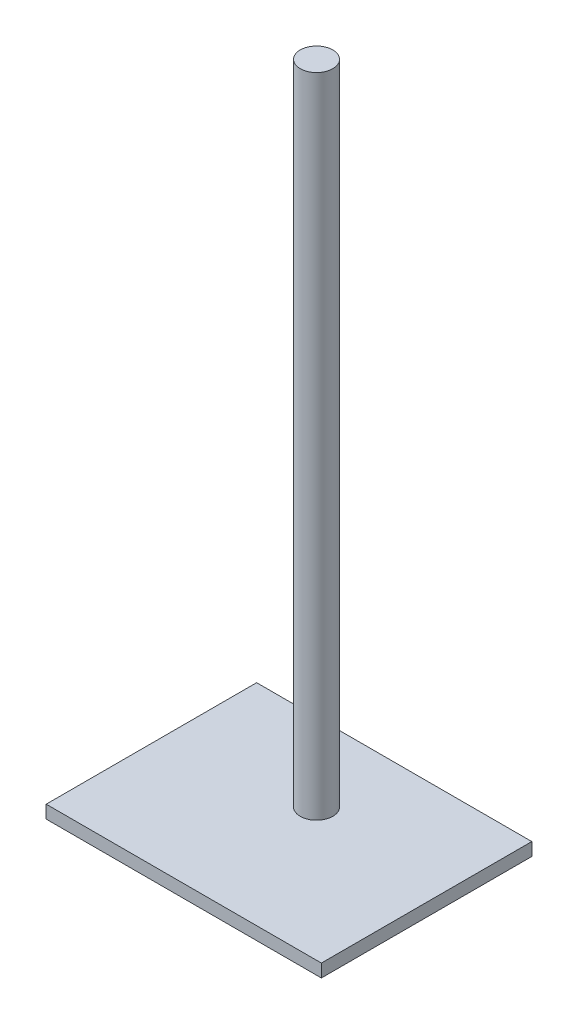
ISO-10303-21;
HEADER;
FILE_DESCRIPTION(('STEP AP214'),'2;1');
FILE_NAME('part.step','',(''),(''),'','','');
FILE_SCHEMA(('AUTOMOTIVE_DESIGN { 1 0 10303 214 1 1 1 1 }'));
ENDSEC;
DATA;
#1=APPLICATION_CONTEXT('core data for automotive mechanical design processes');
#2=APPLICATION_PROTOCOL_DEFINITION('international standard','automotive_design',2000,#1);
#3=PRODUCT_CONTEXT('',#1,'mechanical');
#4=PRODUCT('Part','Part','',(#3));
#5=PRODUCT_RELATED_PRODUCT_CATEGORY('part','',(#4));
#6=PRODUCT_DEFINITION_FORMATION('','',#4);
#7=PRODUCT_DEFINITION_CONTEXT('part definition',#1,'design');
#8=PRODUCT_DEFINITION('design','',#6,#7);
#9=PRODUCT_DEFINITION_SHAPE('','',#8);
#10=(LENGTH_UNIT() NAMED_UNIT(*) SI_UNIT(.MILLI.,.METRE.));
#11=(NAMED_UNIT(*) PLANE_ANGLE_UNIT() SI_UNIT($,.RADIAN.));
#12=(NAMED_UNIT(*) SI_UNIT($,.STERADIAN.) SOLID_ANGLE_UNIT());
#13=UNCERTAINTY_MEASURE_WITH_UNIT(LENGTH_MEASURE(1.E-05),#10,'distance_accuracy_value','');
#14=(GEOMETRIC_REPRESENTATION_CONTEXT(3) GLOBAL_UNCERTAINTY_ASSIGNED_CONTEXT((#13)) GLOBAL_UNIT_ASSIGNED_CONTEXT((#10,
#11,#12)) REPRESENTATION_CONTEXT('',''));
#15=CARTESIAN_POINT('',(0.,0.,0.));
#16=DIRECTION('',(0.,0.,1.));
#17=DIRECTION('',(1.,0.,0.));
#18=AXIS2_PLACEMENT_3D('',#15,#16,#17);
#19=CARTESIAN_POINT('',(0.,500.,0.));
#20=DIRECTION('',(0.,-1.,0.));
#21=DIRECTION('',(0.,0.,-1.));
#22=AXIS2_PLACEMENT_3D('',#19,#20,#21);
#23=CYLINDRICAL_SURFACE('',#22,25.15);
#24=CARTESIAN_POINT('',(0.,500.,0.));
#25=DIRECTION('',(0.,1.,0.));
#26=DIRECTION('',(0.,0.,1.));
#27=AXIS2_PLACEMENT_3D('',#24,#25,#26);
#28=CIRCLE('',#27,25.15);
#29=CARTESIAN_POINT('',(0.,500.,25.15));
#30=VERTEX_POINT('',#29);
#31=EDGE_CURVE('E11',#30,#30,#28,.T.);
#32=ORIENTED_EDGE('',*,*,#31,.F.);
#33=EDGE_LOOP('',(#32));
#34=FACE_BOUND('',#33,.T.);
#35=CARTESIAN_POINT('',(0.,-500.,0.));
#36=DIRECTION('',(0.,1.,0.));
#37=DIRECTION('',(0.,0.,1.));
#38=AXIS2_PLACEMENT_3D('',#35,#36,#37);
#39=CIRCLE('',#38,25.15);
#40=CARTESIAN_POINT('',(0.,-500.,25.15));
#41=VERTEX_POINT('',#40);
#42=EDGE_CURVE('E42',#41,#41,#39,.T.);
#43=ORIENTED_EDGE('',*,*,#42,.T.);
#44=EDGE_LOOP('',(#43));
#45=FACE_BOUND('',#44,.T.);
#46=ADVANCED_FACE('F39',(#34,#45),#23,.T.);
#47=CARTESIAN_POINT('',(0.,500.,0.));
#48=DIRECTION('',(0.,1.,0.));
#49=DIRECTION('',(0.,0.,1.));
#50=AXIS2_PLACEMENT_3D('',#47,#48,#49);
#51=PLANE('',#50);
#52=ORIENTED_EDGE('',*,*,#31,.T.);
#53=EDGE_LOOP('',(#52));
#54=FACE_BOUND('',#53,.T.);
#55=ADVANCED_FACE('F135',(#54),#51,.T.);
#56=CARTESIAN_POINT('',(212.5,-520.,-120.));
#57=DIRECTION('',(-1.,0.,0.));
#58=DIRECTION('',(0.,0.,1.));
#59=AXIS2_PLACEMENT_3D('',#56,#57,#58);
#60=PLANE('',#59);
#61=DIRECTION('',(0.,0.,1.));
#62=VECTOR('',#61,1.);
#63=CARTESIAN_POINT('',(212.5,-500.,-120.));
#64=LINE('',#63,#62);
#65=CARTESIAN_POINT('',(212.5,-500.,-120.));
#66=VERTEX_POINT('',#65);
#67=CARTESIAN_POINT('',(212.5,-500.,205.));
#68=VERTEX_POINT('',#67);
#69=EDGE_CURVE('E106',#66,#68,#64,.T.);
#70=ORIENTED_EDGE('',*,*,#69,.T.);
#71=DIRECTION('',(0.,1.,0.));
#72=VECTOR('',#71,1.);
#73=CARTESIAN_POINT('',(212.5,-520.,205.));
#74=LINE('',#73,#72);
#75=CARTESIAN_POINT('',(212.5,-520.,205.));
#76=VERTEX_POINT('',#75);
#77=EDGE_CURVE('E97',#76,#68,#74,.T.);
#78=ORIENTED_EDGE('',*,*,#77,.F.);
#79=DIRECTION('',(0.,0.,1.));
#80=VECTOR('',#79,1.);
#81=CARTESIAN_POINT('',(212.5,-520.,-120.));
#82=LINE('',#81,#80);
#83=CARTESIAN_POINT('',(212.5,-520.,-120.));
#84=VERTEX_POINT('',#83);
#85=EDGE_CURVE('E91',#84,#76,#82,.T.);
#86=ORIENTED_EDGE('',*,*,#85,.F.);
#87=DIRECTION('',(0.,1.,0.));
#88=VECTOR('',#87,1.);
#89=CARTESIAN_POINT('',(212.5,-520.,-120.));
#90=LINE('',#89,#88);
#91=EDGE_CURVE('E102',#84,#66,#90,.T.);
#92=ORIENTED_EDGE('',*,*,#91,.T.);
#93=EDGE_LOOP('',(#70,#78,#86,#92));
#94=FACE_BOUND('',#93,.T.);
#95=ADVANCED_FACE('F124',(#94),#60,.F.);
#96=CARTESIAN_POINT('',(-212.5,-520.,205.));
#97=DIRECTION('',(0.,0.,-1.));
#98=DIRECTION('',(-1.,0.,0.));
#99=AXIS2_PLACEMENT_3D('',#96,#97,#98);
#100=PLANE('',#99);
#101=DIRECTION('',(-1.,0.,0.));
#102=VECTOR('',#101,1.);
#103=CARTESIAN_POINT('',(-212.5,-500.,205.));
#104=LINE('',#103,#102);
#105=CARTESIAN_POINT('',(-212.5,-500.,205.));
#106=VERTEX_POINT('',#105);
#107=EDGE_CURVE('E96',#68,#106,#104,.T.);
#108=ORIENTED_EDGE('',*,*,#107,.T.);
#109=DIRECTION('',(0.,1.,0.));
#110=VECTOR('',#109,1.);
#111=CARTESIAN_POINT('',(-212.5,-520.,205.));
#112=LINE('',#111,#110);
#113=CARTESIAN_POINT('',(-212.5,-520.,205.));
#114=VERTEX_POINT('',#113);
#115=EDGE_CURVE('E94',#114,#106,#112,.T.);
#116=ORIENTED_EDGE('',*,*,#115,.F.);
#117=DIRECTION('',(-1.,0.,0.));
#118=VECTOR('',#117,1.);
#119=CARTESIAN_POINT('',(-212.5,-520.,205.));
#120=LINE('',#119,#118);
#121=EDGE_CURVE('E86',#76,#114,#120,.T.);
#122=ORIENTED_EDGE('',*,*,#121,.F.);
#123=ORIENTED_EDGE('',*,*,#77,.T.);
#124=EDGE_LOOP('',(#108,#116,#122,#123));
#125=FACE_BOUND('',#124,.T.);
#126=ADVANCED_FACE('F95',(#125),#100,.F.);
#127=CARTESIAN_POINT('',(-212.5,-520.,-120.));
#128=DIRECTION('',(1.,0.,0.));
#129=DIRECTION('',(0.,0.,-1.));
#130=AXIS2_PLACEMENT_3D('',#127,#128,#129);
#131=PLANE('',#130);
#132=DIRECTION('',(0.,0.,-1.));
#133=VECTOR('',#132,1.);
#134=CARTESIAN_POINT('',(-212.5,-500.,-120.));
#135=LINE('',#134,#133);
#136=CARTESIAN_POINT('',(-212.5,-500.,-120.));
#137=VERTEX_POINT('',#136);
#138=EDGE_CURVE('E72',#106,#137,#135,.T.);
#139=ORIENTED_EDGE('',*,*,#138,.T.);
#140=DIRECTION('',(0.,1.,0.));
#141=VECTOR('',#140,1.);
#142=CARTESIAN_POINT('',(-212.5,-520.,-120.));
#143=LINE('',#142,#141);
#144=CARTESIAN_POINT('',(-212.5,-520.,-120.));
#145=VERTEX_POINT('',#144);
#146=EDGE_CURVE('E98',#145,#137,#143,.T.);
#147=ORIENTED_EDGE('',*,*,#146,.F.);
#148=DIRECTION('',(0.,0.,-1.));
#149=VECTOR('',#148,1.);
#150=CARTESIAN_POINT('',(-212.5,-520.,-120.));
#151=LINE('',#150,#149);
#152=EDGE_CURVE('E89',#114,#145,#151,.T.);
#153=ORIENTED_EDGE('',*,*,#152,.F.);
#154=ORIENTED_EDGE('',*,*,#115,.T.);
#155=EDGE_LOOP('',(#139,#147,#153,#154));
#156=FACE_BOUND('',#155,.T.);
#157=ADVANCED_FACE('F100',(#156),#131,.F.);
#158=CARTESIAN_POINT('',(-212.5,-520.,-120.));
#159=DIRECTION('',(0.,0.,1.));
#160=DIRECTION('',(1.,0.,0.));
#161=AXIS2_PLACEMENT_3D('',#158,#159,#160);
#162=PLANE('',#161);
#163=DIRECTION('',(1.,0.,0.));
#164=VECTOR('',#163,1.);
#165=CARTESIAN_POINT('',(-212.5,-500.,-120.));
#166=LINE('',#165,#164);
#167=EDGE_CURVE('E78',#137,#66,#166,.T.);
#168=ORIENTED_EDGE('',*,*,#167,.T.);
#169=ORIENTED_EDGE('',*,*,#91,.F.);
#170=DIRECTION('',(1.,0.,0.));
#171=VECTOR('',#170,1.);
#172=CARTESIAN_POINT('',(-212.5,-520.,-120.));
#173=LINE('',#172,#171);
#174=EDGE_CURVE('E55',#145,#84,#173,.T.);
#175=ORIENTED_EDGE('',*,*,#174,.F.);
#176=ORIENTED_EDGE('',*,*,#146,.T.);
#177=EDGE_LOOP('',(#168,#169,#175,#176));
#178=FACE_BOUND('',#177,.T.);
#179=ADVANCED_FACE('F125',(#178),#162,.F.);
#180=CARTESIAN_POINT('',(0.,-520.,0.));
#181=DIRECTION('',(0.,1.,0.));
#182=DIRECTION('',(0.,0.,1.));
#183=AXIS2_PLACEMENT_3D('',#180,#181,#182);
#184=PLANE('',#183);
#185=ORIENTED_EDGE('',*,*,#85,.T.);
#186=ORIENTED_EDGE('',*,*,#121,.T.);
#187=ORIENTED_EDGE('',*,*,#152,.T.);
#188=ORIENTED_EDGE('',*,*,#174,.T.);
#189=EDGE_LOOP('',(#185,#186,#187,#188));
#190=FACE_BOUND('',#189,.T.);
#191=ADVANCED_FACE('F87',(#190),#184,.F.);
#192=CARTESIAN_POINT('',(0.,-500.,0.));
#193=DIRECTION('',(0.,1.,0.));
#194=DIRECTION('',(0.,0.,1.));
#195=AXIS2_PLACEMENT_3D('',#192,#193,#194);
#196=PLANE('',#195);
#197=ORIENTED_EDGE('',*,*,#42,.F.);
#198=EDGE_LOOP('',(#197));
#199=FACE_BOUND('',#198,.T.);
#200=ORIENTED_EDGE('',*,*,#69,.F.);
#201=ORIENTED_EDGE('',*,*,#167,.F.);
#202=ORIENTED_EDGE('',*,*,#138,.F.);
#203=ORIENTED_EDGE('',*,*,#107,.F.);
#204=EDGE_LOOP('',(#200,#201,#202,#203));
#205=FACE_BOUND('',#204,.T.);
#206=ADVANCED_FACE('F118',(#199,#205),#196,.T.);
#207=CLOSED_SHELL('',(#46,#55,#95,#126,#157,#179,#191,#206));
#208=MANIFOLD_SOLID_BREP('B2',#207);
#209=ADVANCED_BREP_SHAPE_REPRESENTATION('',(#18,#208),#14);
#210=SHAPE_DEFINITION_REPRESENTATION(#9,#209);
ENDSEC;
END-ISO-10303-21;
